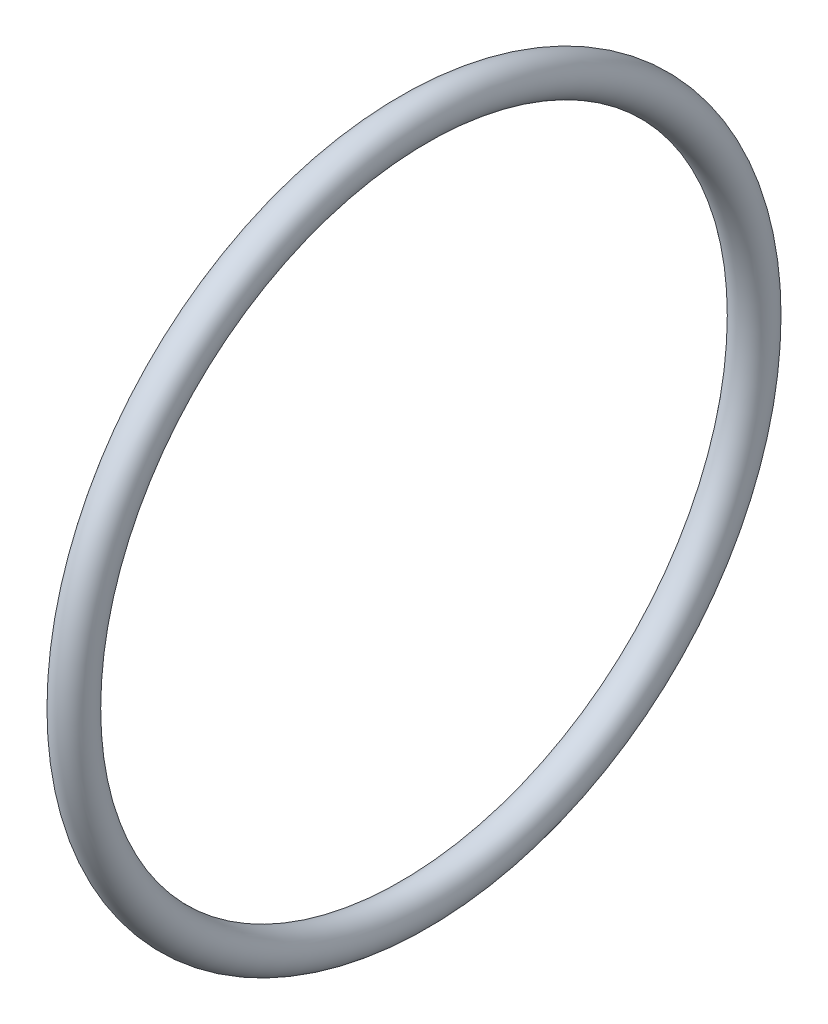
from build123d import *

# Parameters (mm, degrees)
ESQUISSE2_R   = 1.1
ESQUISSE2_R_2 = 0.732622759


with BuildPart() as part:
    # Esquisse2 → R_volution1 (revolve)
    with BuildSketch(Plane(origin=(0, 0, 0), x_dir=(-1, 0, 0), z_dir=(0, 1, 0))):
        with Locations((-2.492989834, 19.681818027)):
            Circle(ESQUISSE2_R)
        with Locations((-2.492989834, 19.681818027)):
            Circle(ESQUISSE2_R_2, mode=Mode.SUBTRACT)
    revolve(axis=Axis((0, 0, 0), (1, 0, 0)))


solid = part.part
